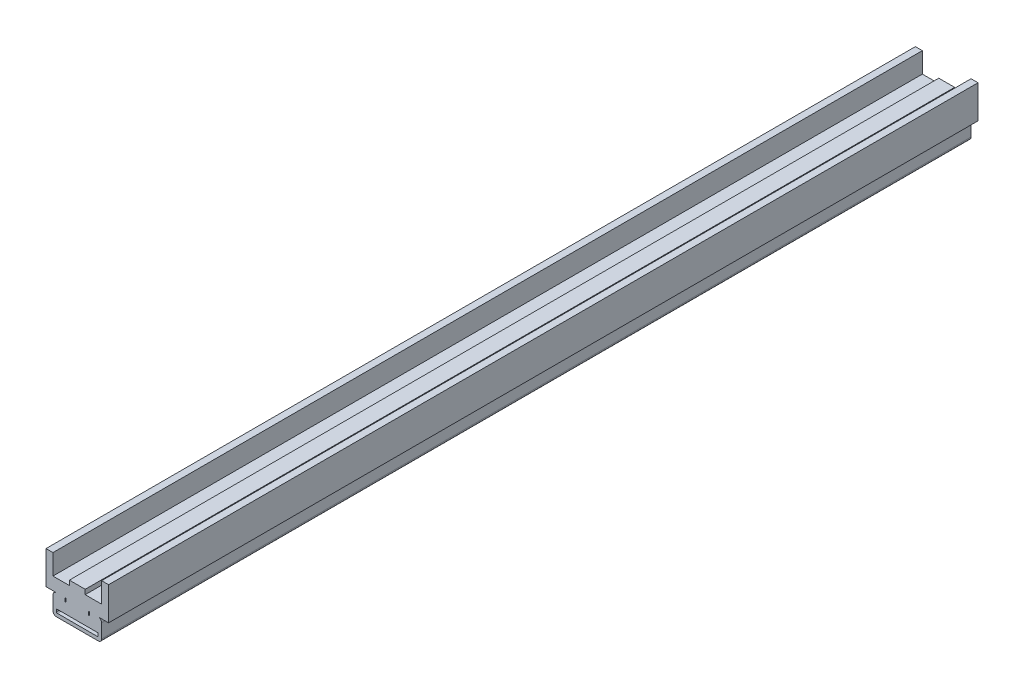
ISO-10303-21;
HEADER;
FILE_DESCRIPTION(('STEP AP214'),'2;1');
FILE_NAME('part.step','',(''),(''),'','','');
FILE_SCHEMA(('AUTOMOTIVE_DESIGN { 1 0 10303 214 1 1 1 1 }'));
ENDSEC;
DATA;
#1=APPLICATION_CONTEXT('core data for automotive mechanical design processes');
#2=APPLICATION_PROTOCOL_DEFINITION('international standard','automotive_design',2000,#1);
#3=PRODUCT_CONTEXT('',#1,'mechanical');
#4=PRODUCT('Part','Part','',(#3));
#5=PRODUCT_RELATED_PRODUCT_CATEGORY('part','',(#4));
#6=PRODUCT_DEFINITION_FORMATION('','',#4);
#7=PRODUCT_DEFINITION_CONTEXT('part definition',#1,'design');
#8=PRODUCT_DEFINITION('design','',#6,#7);
#9=PRODUCT_DEFINITION_SHAPE('','',#8);
#10=(LENGTH_UNIT() NAMED_UNIT(*) SI_UNIT(.MILLI.,.METRE.));
#11=(NAMED_UNIT(*) PLANE_ANGLE_UNIT() SI_UNIT($,.RADIAN.));
#12=(NAMED_UNIT(*) SI_UNIT($,.STERADIAN.) SOLID_ANGLE_UNIT());
#13=UNCERTAINTY_MEASURE_WITH_UNIT(LENGTH_MEASURE(1.E-05),#10,'distance_accuracy_value','');
#14=(GEOMETRIC_REPRESENTATION_CONTEXT(3) GLOBAL_UNCERTAINTY_ASSIGNED_CONTEXT((#13)) GLOBAL_UNIT_ASSIGNED_CONTEXT((#10,
#11,#12)) REPRESENTATION_CONTEXT('',''));
#15=CARTESIAN_POINT('',(0.,0.,0.));
#16=DIRECTION('',(0.,0.,1.));
#17=DIRECTION('',(1.,0.,0.));
#18=AXIS2_PLACEMENT_3D('',#15,#16,#17);
#19=CARTESIAN_POINT('',(12.0000057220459,9.99999999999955,500.));
#20=DIRECTION('',(0.,0.,-1.));
#21=DIRECTION('',(-1.,0.,0.));
#22=AXIS2_PLACEMENT_3D('',#19,#20,#21);
#23=PLANE('',#22);
#24=DIRECTION('',(0.,-1.,0.));
#25=VECTOR('',#24,1.);
#26=CARTESIAN_POINT('',(6.5,11.9999999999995,500.));
#27=LINE('',#26,#25);
#28=CARTESIAN_POINT('',(6.5,11.9999999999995,500.));
#29=VERTEX_POINT('',#28);
#30=CARTESIAN_POINT('',(6.5,9.99999999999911,500.));
#31=VERTEX_POINT('',#30);
#32=EDGE_CURVE('E277',#29,#31,#27,.T.);
#33=ORIENTED_EDGE('',*,*,#32,.F.);
#34=DIRECTION('',(-1.,0.,0.));
#35=VECTOR('',#34,1.);
#36=CARTESIAN_POINT('',(6.5,11.9999999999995,500.));
#37=LINE('',#36,#35);
#38=CARTESIAN_POINT('',(7.,11.9999999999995,500.));
#39=VERTEX_POINT('',#38);
#40=EDGE_CURVE('E285',#39,#29,#37,.T.);
#41=ORIENTED_EDGE('',*,*,#40,.F.);
#42=DIRECTION('',(0.,1.,0.));
#43=VECTOR('',#42,1.);
#44=CARTESIAN_POINT('',(7.,11.9999999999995,500.));
#45=LINE('',#44,#43);
#46=CARTESIAN_POINT('',(7.,9.99999999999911,500.));
#47=VERTEX_POINT('',#46);
#48=EDGE_CURVE('E282',#47,#39,#45,.T.);
#49=ORIENTED_EDGE('',*,*,#48,.F.);
#50=DIRECTION('',(1.,0.,0.));
#51=VECTOR('',#50,1.);
#52=CARTESIAN_POINT('',(6.5,9.99999999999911,500.));
#53=LINE('',#52,#51);
#54=EDGE_CURVE('E279',#31,#47,#53,.T.);
#55=ORIENTED_EDGE('',*,*,#54,.F.);
#56=EDGE_LOOP('',(#33,#41,#49,#55));
#57=FACE_BOUND('',#56,.T.);
#58=DIRECTION('',(1.,0.,0.));
#59=VECTOR('',#58,1.);
#60=CARTESIAN_POINT('',(-14.0000057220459,0.,500.));
#61=LINE('',#60,#59);
#62=CARTESIAN_POINT('',(-12.0000057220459,0.,500.));
#63=VERTEX_POINT('',#62);
#64=CARTESIAN_POINT('',(12.0000057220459,0.,500.));
#65=VERTEX_POINT('',#64);
#66=EDGE_CURVE('E334',#63,#65,#61,.T.);
#67=ORIENTED_EDGE('',*,*,#66,.T.);
#68=CARTESIAN_POINT('',(12.0000057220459,2.,500.));
#69=DIRECTION('',(0.,0.,-1.));
#70=DIRECTION('',(-1.,0.,0.));
#71=AXIS2_PLACEMENT_3D('',#68,#69,#70);
#72=CIRCLE('',#71,2.);
#73=CARTESIAN_POINT('',(14.0000057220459,2.,500.));
#74=VERTEX_POINT('',#73);
#75=EDGE_CURVE('E471',#65,#74,#72,.F.);
#76=ORIENTED_EDGE('',*,*,#75,.T.);
#77=DIRECTION('',(0.,1.,0.));
#78=VECTOR('',#77,1.);
#79=CARTESIAN_POINT('',(14.0000057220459,9.99999999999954,500.));
#80=LINE('',#79,#78);
#81=CARTESIAN_POINT('',(14.0000057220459,9.99999999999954,500.));
#82=VERTEX_POINT('',#81);
#83=EDGE_CURVE('E337',#74,#82,#80,.T.);
#84=ORIENTED_EDGE('',*,*,#83,.T.);
#85=CARTESIAN_POINT('',(12.0000057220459,9.99999999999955,500.));
#86=DIRECTION('',(0.,0.,1.));
#87=DIRECTION('',(-1.,0.,0.));
#88=AXIS2_PLACEMENT_3D('',#85,#86,#87);
#89=CIRCLE('',#88,2.);
#90=CARTESIAN_POINT('',(12.0000057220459,11.9999999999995,500.));
#91=VERTEX_POINT('',#90);
#92=EDGE_CURVE('E340',#82,#91,#89,.T.);
#93=ORIENTED_EDGE('',*,*,#92,.T.);
#94=DIRECTION('',(1.,0.,0.));
#95=VECTOR('',#94,1.);
#96=CARTESIAN_POINT('',(12.0000057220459,11.9999999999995,500.));
#97=LINE('',#96,#95);
#98=CARTESIAN_POINT('',(18.,11.9999999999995,500.));
#99=VERTEX_POINT('',#98);
#100=EDGE_CURVE('E342',#91,#99,#97,.T.);
#101=ORIENTED_EDGE('',*,*,#100,.T.);
#102=DIRECTION('',(0.,1.,0.));
#103=VECTOR('',#102,1.);
#104=CARTESIAN_POINT('',(18.,30.9999999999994,500.));
#105=LINE('',#104,#103);
#106=CARTESIAN_POINT('',(18.,30.9999999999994,500.));
#107=VERTEX_POINT('',#106);
#108=EDGE_CURVE('E344',#99,#107,#105,.T.);
#109=ORIENTED_EDGE('',*,*,#108,.T.);
#110=DIRECTION('',(-1.,0.,0.));
#111=VECTOR('',#110,1.);
#112=CARTESIAN_POINT('',(14.0000000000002,30.9999999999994,500.));
#113=LINE('',#112,#111);
#114=CARTESIAN_POINT('',(14.0000000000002,30.9999999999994,500.));
#115=VERTEX_POINT('',#114);
#116=EDGE_CURVE('E346',#107,#115,#113,.T.);
#117=ORIENTED_EDGE('',*,*,#116,.T.);
#118=DIRECTION('',(0.,-1.,0.));
#119=VECTOR('',#118,1.);
#120=CARTESIAN_POINT('',(14.0000000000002,30.9999999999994,500.));
#121=LINE('',#120,#119);
#122=CARTESIAN_POINT('',(14.0000000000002,19.3,500.));
#123=VERTEX_POINT('',#122);
#124=EDGE_CURVE('E348',#115,#123,#121,.T.);
#125=ORIENTED_EDGE('',*,*,#124,.T.);
#126=DIRECTION('',(-1.,0.,0.));
#127=VECTOR('',#126,1.);
#128=CARTESIAN_POINT('',(4.55,19.3,500.));
#129=LINE('',#128,#127);
#130=CARTESIAN_POINT('',(4.55,19.3,500.));
#131=VERTEX_POINT('',#130);
#132=EDGE_CURVE('E350',#123,#131,#129,.T.);
#133=ORIENTED_EDGE('',*,*,#132,.T.);
#134=DIRECTION('',(0.,1.,0.));
#135=VECTOR('',#134,1.);
#136=CARTESIAN_POINT('',(4.55,22.,500.));
#137=LINE('',#136,#135);
#138=CARTESIAN_POINT('',(4.55,22.,500.));
#139=VERTEX_POINT('',#138);
#140=EDGE_CURVE('E352',#131,#139,#137,.T.);
#141=ORIENTED_EDGE('',*,*,#140,.T.);
#142=DIRECTION('',(-1.,0.,0.));
#143=VECTOR('',#142,1.);
#144=CARTESIAN_POINT('',(-4.55,22.,500.));
#145=LINE('',#144,#143);
#146=CARTESIAN_POINT('',(-4.55,22.,500.));
#147=VERTEX_POINT('',#146);
#148=EDGE_CURVE('E354',#139,#147,#145,.T.);
#149=ORIENTED_EDGE('',*,*,#148,.T.);
#150=DIRECTION('',(0.,-1.,0.));
#151=VECTOR('',#150,1.);
#152=CARTESIAN_POINT('',(-4.55,22.,500.));
#153=LINE('',#152,#151);
#154=CARTESIAN_POINT('',(-4.55,19.3,500.));
#155=VERTEX_POINT('',#154);
#156=EDGE_CURVE('E356',#147,#155,#153,.T.);
#157=ORIENTED_EDGE('',*,*,#156,.T.);
#158=DIRECTION('',(-1.,0.,0.));
#159=VECTOR('',#158,1.);
#160=CARTESIAN_POINT('',(-14.0000000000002,19.3,500.));
#161=LINE('',#160,#159);
#162=CARTESIAN_POINT('',(-14.0000000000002,19.3,500.));
#163=VERTEX_POINT('',#162);
#164=EDGE_CURVE('E358',#155,#163,#161,.T.);
#165=ORIENTED_EDGE('',*,*,#164,.T.);
#166=DIRECTION('',(0.,1.,0.));
#167=VECTOR('',#166,1.);
#168=CARTESIAN_POINT('',(-14.0000000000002,31.,500.));
#169=LINE('',#168,#167);
#170=CARTESIAN_POINT('',(-14.0000000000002,31.,500.));
#171=VERTEX_POINT('',#170);
#172=EDGE_CURVE('E360',#163,#171,#169,.T.);
#173=ORIENTED_EDGE('',*,*,#172,.T.);
#174=DIRECTION('',(-1.,0.,0.));
#175=VECTOR('',#174,1.);
#176=CARTESIAN_POINT('',(-18.,31.,500.));
#177=LINE('',#176,#175);
#178=CARTESIAN_POINT('',(-18.,31.,500.));
#179=VERTEX_POINT('',#178);
#180=EDGE_CURVE('E362',#171,#179,#177,.T.);
#181=ORIENTED_EDGE('',*,*,#180,.T.);
#182=DIRECTION('',(0.,-1.,0.));
#183=VECTOR('',#182,1.);
#184=CARTESIAN_POINT('',(-18.,31.,500.));
#185=LINE('',#184,#183);
#186=CARTESIAN_POINT('',(-18.,12.,500.));
#187=VERTEX_POINT('',#186);
#188=EDGE_CURVE('E364',#179,#187,#185,.T.);
#189=ORIENTED_EDGE('',*,*,#188,.T.);
#190=DIRECTION('',(1.,0.,0.));
#191=VECTOR('',#190,1.);
#192=CARTESIAN_POINT('',(-18.,12.,500.));
#193=LINE('',#192,#191);
#194=CARTESIAN_POINT('',(-12.0000057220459,12.,500.));
#195=VERTEX_POINT('',#194);
#196=EDGE_CURVE('E366',#187,#195,#193,.T.);
#197=ORIENTED_EDGE('',*,*,#196,.T.);
#198=CARTESIAN_POINT('',(-12.0000057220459,10.,500.));
#199=DIRECTION('',(0.,0.,1.));
#200=DIRECTION('',(1.,0.,0.));
#201=AXIS2_PLACEMENT_3D('',#198,#199,#200);
#202=CIRCLE('',#201,2.);
#203=CARTESIAN_POINT('',(-14.0000057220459,10.,500.));
#204=VERTEX_POINT('',#203);
#205=EDGE_CURVE('E368',#195,#204,#202,.T.);
#206=ORIENTED_EDGE('',*,*,#205,.T.);
#207=DIRECTION('',(0.,-1.,0.));
#208=VECTOR('',#207,1.);
#209=CARTESIAN_POINT('',(-14.0000057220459,10.,500.));
#210=LINE('',#209,#208);
#211=CARTESIAN_POINT('',(-14.0000057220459,2.,500.));
#212=VERTEX_POINT('',#211);
#213=EDGE_CURVE('E370',#204,#212,#210,.T.);
#214=ORIENTED_EDGE('',*,*,#213,.T.);
#215=CARTESIAN_POINT('',(-12.0000057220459,2.,500.));
#216=DIRECTION('',(0.,0.,-1.));
#217=DIRECTION('',(-1.,0.,0.));
#218=AXIS2_PLACEMENT_3D('',#215,#216,#217);
#219=CIRCLE('',#218,2.);
#220=EDGE_CURVE('E469',#212,#63,#219,.F.);
#221=ORIENTED_EDGE('',*,*,#220,.T.);
#222=EDGE_LOOP('',(#67,#76,#84,#93,#101,#109,#117,#125,#133,#141,#149,#157,#165,#173,#181,#189,
#197,#206,#214,#221));
#223=FACE_BOUND('',#222,.T.);
#224=DIRECTION('',(1.,0.,0.));
#225=VECTOR('',#224,1.);
#226=CARTESIAN_POINT('',(-12.0000057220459,2.,500.));
#227=LINE('',#226,#225);
#228=CARTESIAN_POINT('',(-11.5000057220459,2.,500.));
#229=VERTEX_POINT('',#228);
#230=CARTESIAN_POINT('',(11.499993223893,2.,500.));
#231=VERTEX_POINT('',#230);
#232=EDGE_CURVE('E308',#229,#231,#227,.T.);
#233=ORIENTED_EDGE('',*,*,#232,.F.);
#234=CARTESIAN_POINT('',(-11.5000057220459,2.5,500.));
#235=DIRECTION('',(0.,0.,-1.));
#236=DIRECTION('',(-1.,0.,0.));
#237=AXIS2_PLACEMENT_3D('',#234,#235,#236);
#238=CIRCLE('',#237,0.5);
#239=CARTESIAN_POINT('',(-12.0000057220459,2.5,500.));
#240=VERTEX_POINT('',#239);
#241=EDGE_CURVE('E9',#229,#240,#238,.T.);
#242=ORIENTED_EDGE('',*,*,#241,.T.);
#243=DIRECTION('',(0.,-1.,0.));
#244=VECTOR('',#243,1.);
#245=CARTESIAN_POINT('',(-12.0000057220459,4.00000000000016,500.));
#246=LINE('',#245,#244);
#247=CARTESIAN_POINT('',(-12.0000057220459,4.00000000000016,500.));
#248=VERTEX_POINT('',#247);
#249=EDGE_CURVE('E317',#248,#240,#246,.T.);
#250=ORIENTED_EDGE('',*,*,#249,.F.);
#251=DIRECTION('',(-1.,0.,0.));
#252=VECTOR('',#251,1.);
#253=CARTESIAN_POINT('',(-12.0000057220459,4.00000000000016,500.));
#254=LINE('',#253,#252);
#255=CARTESIAN_POINT('',(11.999993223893,4.00000000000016,500.));
#256=VERTEX_POINT('',#255);
#257=EDGE_CURVE('E314',#256,#248,#254,.T.);
#258=ORIENTED_EDGE('',*,*,#257,.F.);
#259=DIRECTION('',(0.,1.,0.));
#260=VECTOR('',#259,1.);
#261=CARTESIAN_POINT('',(11.999993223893,4.00000000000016,500.));
#262=LINE('',#261,#260);
#263=CARTESIAN_POINT('',(11.999993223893,2.5,500.));
#264=VERTEX_POINT('',#263);
#265=EDGE_CURVE('E311',#264,#256,#262,.T.);
#266=ORIENTED_EDGE('',*,*,#265,.F.);
#267=CARTESIAN_POINT('',(11.499993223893,2.5,500.));
#268=DIRECTION('',(0.,0.,-1.));
#269=DIRECTION('',(-1.,0.,0.));
#270=AXIS2_PLACEMENT_3D('',#267,#268,#269);
#271=CIRCLE('',#270,0.5);
#272=EDGE_CURVE('E486',#264,#231,#271,.T.);
#273=ORIENTED_EDGE('',*,*,#272,.T.);
#274=EDGE_LOOP('',(#233,#242,#250,#258,#266,#273));
#275=FACE_BOUND('',#274,.T.);
#276=DIRECTION('',(0.,1.,0.));
#277=VECTOR('',#276,1.);
#278=CARTESIAN_POINT('',(-6.5,11.9999999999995,500.));
#279=LINE('',#278,#277);
#280=CARTESIAN_POINT('',(-6.5,9.99999999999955,500.));
#281=VERTEX_POINT('',#280);
#282=CARTESIAN_POINT('',(-6.5,11.9999999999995,500.));
#283=VERTEX_POINT('',#282);
#284=EDGE_CURVE('E236',#281,#283,#279,.T.);
#285=ORIENTED_EDGE('',*,*,#284,.F.);
#286=DIRECTION('',(1.,0.,0.));
#287=VECTOR('',#286,1.);
#288=CARTESIAN_POINT('',(-6.5,9.99999999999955,500.));
#289=LINE('',#288,#287);
#290=CARTESIAN_POINT('',(-7.,9.99999999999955,500.));
#291=VERTEX_POINT('',#290);
#292=EDGE_CURVE('E261',#291,#281,#289,.T.);
#293=ORIENTED_EDGE('',*,*,#292,.F.);
#294=DIRECTION('',(0.,-1.,0.));
#295=VECTOR('',#294,1.);
#296=CARTESIAN_POINT('',(-7.,11.9999999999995,500.));
#297=LINE('',#296,#295);
#298=CARTESIAN_POINT('',(-7.,11.9999999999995,500.));
#299=VERTEX_POINT('',#298);
#300=EDGE_CURVE('E259',#299,#291,#297,.T.);
#301=ORIENTED_EDGE('',*,*,#300,.F.);
#302=DIRECTION('',(-1.,0.,0.));
#303=VECTOR('',#302,1.);
#304=CARTESIAN_POINT('',(-7.,11.9999999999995,500.));
#305=LINE('',#304,#303);
#306=EDGE_CURVE('E246',#283,#299,#305,.T.);
#307=ORIENTED_EDGE('',*,*,#306,.F.);
#308=EDGE_LOOP('',(#285,#293,#301,#307));
#309=FACE_BOUND('',#308,.T.);
#310=ADVANCED_FACE('F14',(#57,#223,#275,#309),#23,.F.);
#311=CARTESIAN_POINT('',(12.0000057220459,9.99999999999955,0.));
#312=DIRECTION('',(0.,0.,-1.));
#313=DIRECTION('',(-1.,0.,0.));
#314=AXIS2_PLACEMENT_3D('',#311,#312,#313);
#315=PLANE('',#314);
#316=DIRECTION('',(-1.,0.,0.));
#317=VECTOR('',#316,1.);
#318=CARTESIAN_POINT('',(6.5,11.9999999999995,0.));
#319=LINE('',#318,#317);
#320=CARTESIAN_POINT('',(7.,11.9999999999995,0.));
#321=VERTEX_POINT('',#320);
#322=CARTESIAN_POINT('',(6.5,11.9999999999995,0.));
#323=VERTEX_POINT('',#322);
#324=EDGE_CURVE('E280',#321,#323,#319,.T.);
#325=ORIENTED_EDGE('',*,*,#324,.T.);
#326=DIRECTION('',(0.,-1.,0.));
#327=VECTOR('',#326,1.);
#328=CARTESIAN_POINT('',(6.5,11.9999999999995,0.));
#329=LINE('',#328,#327);
#330=CARTESIAN_POINT('',(6.5,9.99999999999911,0.));
#331=VERTEX_POINT('',#330);
#332=EDGE_CURVE('E254',#323,#331,#329,.T.);
#333=ORIENTED_EDGE('',*,*,#332,.T.);
#334=DIRECTION('',(1.,0.,0.));
#335=VECTOR('',#334,1.);
#336=CARTESIAN_POINT('',(6.5,9.99999999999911,0.));
#337=LINE('',#336,#335);
#338=CARTESIAN_POINT('',(7.,9.99999999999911,0.));
#339=VERTEX_POINT('',#338);
#340=EDGE_CURVE('E290',#331,#339,#337,.T.);
#341=ORIENTED_EDGE('',*,*,#340,.T.);
#342=DIRECTION('',(0.,1.,0.));
#343=VECTOR('',#342,1.);
#344=CARTESIAN_POINT('',(7.,11.9999999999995,0.));
#345=LINE('',#344,#343);
#346=EDGE_CURVE('E293',#339,#321,#345,.T.);
#347=ORIENTED_EDGE('',*,*,#346,.T.);
#348=EDGE_LOOP('',(#325,#333,#341,#347));
#349=FACE_BOUND('',#348,.T.);
#350=DIRECTION('',(0.,1.,0.));
#351=VECTOR('',#350,1.);
#352=CARTESIAN_POINT('',(14.0000057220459,9.99999999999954,0.));
#353=LINE('',#352,#351);
#354=CARTESIAN_POINT('',(14.0000057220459,2.,0.));
#355=VERTEX_POINT('',#354);
#356=CARTESIAN_POINT('',(14.0000057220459,9.99999999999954,0.));
#357=VERTEX_POINT('',#356);
#358=EDGE_CURVE('E376',#355,#357,#353,.T.);
#359=ORIENTED_EDGE('',*,*,#358,.F.);
#360=CARTESIAN_POINT('',(12.0000057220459,2.,0.));
#361=DIRECTION('',(0.,0.,-1.));
#362=DIRECTION('',(-1.,0.,0.));
#363=AXIS2_PLACEMENT_3D('',#360,#361,#362);
#364=CIRCLE('',#363,2.);
#365=CARTESIAN_POINT('',(12.0000057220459,0.,0.));
#366=VERTEX_POINT('',#365);
#367=EDGE_CURVE('E462',#355,#366,#364,.T.);
#368=ORIENTED_EDGE('',*,*,#367,.T.);
#369=DIRECTION('',(1.,0.,0.));
#370=VECTOR('',#369,1.);
#371=CARTESIAN_POINT('',(-14.0000057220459,0.,0.));
#372=LINE('',#371,#370);
#373=CARTESIAN_POINT('',(-12.0000057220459,0.,0.));
#374=VERTEX_POINT('',#373);
#375=EDGE_CURVE('E333',#374,#366,#372,.T.);
#376=ORIENTED_EDGE('',*,*,#375,.F.);
#377=CARTESIAN_POINT('',(-12.0000057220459,2.,0.));
#378=DIRECTION('',(0.,0.,-1.));
#379=DIRECTION('',(-1.,0.,0.));
#380=AXIS2_PLACEMENT_3D('',#377,#378,#379);
#381=CIRCLE('',#380,2.);
#382=CARTESIAN_POINT('',(-14.0000057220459,2.,0.));
#383=VERTEX_POINT('',#382);
#384=EDGE_CURVE('E460',#374,#383,#381,.T.);
#385=ORIENTED_EDGE('',*,*,#384,.T.);
#386=DIRECTION('',(0.,-1.,0.));
#387=VECTOR('',#386,1.);
#388=CARTESIAN_POINT('',(-14.0000057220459,10.,0.));
#389=LINE('',#388,#387);
#390=CARTESIAN_POINT('',(-14.0000057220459,10.,0.));
#391=VERTEX_POINT('',#390);
#392=EDGE_CURVE('E338',#391,#383,#389,.T.);
#393=ORIENTED_EDGE('',*,*,#392,.F.);
#394=CARTESIAN_POINT('',(-12.0000057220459,10.,0.));
#395=DIRECTION('',(0.,0.,1.));
#396=DIRECTION('',(1.,0.,0.));
#397=AXIS2_PLACEMENT_3D('',#394,#395,#396);
#398=CIRCLE('',#397,2.);
#399=CARTESIAN_POINT('',(-12.0000057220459,12.,0.));
#400=VERTEX_POINT('',#399);
#401=EDGE_CURVE('E406',#400,#391,#398,.T.);
#402=ORIENTED_EDGE('',*,*,#401,.F.);
#403=DIRECTION('',(1.,0.,0.));
#404=VECTOR('',#403,1.);
#405=CARTESIAN_POINT('',(-18.,12.,0.));
#406=LINE('',#405,#404);
#407=CARTESIAN_POINT('',(-18.,12.,0.));
#408=VERTEX_POINT('',#407);
#409=EDGE_CURVE('E404',#408,#400,#406,.T.);
#410=ORIENTED_EDGE('',*,*,#409,.F.);
#411=DIRECTION('',(0.,-1.,0.));
#412=VECTOR('',#411,1.);
#413=CARTESIAN_POINT('',(-18.,31.,0.));
#414=LINE('',#413,#412);
#415=CARTESIAN_POINT('',(-18.,31.,0.));
#416=VERTEX_POINT('',#415);
#417=EDGE_CURVE('E402',#416,#408,#414,.T.);
#418=ORIENTED_EDGE('',*,*,#417,.F.);
#419=DIRECTION('',(-1.,0.,0.));
#420=VECTOR('',#419,1.);
#421=CARTESIAN_POINT('',(-18.,31.,0.));
#422=LINE('',#421,#420);
#423=CARTESIAN_POINT('',(-14.0000000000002,31.,0.));
#424=VERTEX_POINT('',#423);
#425=EDGE_CURVE('E400',#424,#416,#422,.T.);
#426=ORIENTED_EDGE('',*,*,#425,.F.);
#427=DIRECTION('',(0.,1.,0.));
#428=VECTOR('',#427,1.);
#429=CARTESIAN_POINT('',(-14.0000000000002,31.,0.));
#430=LINE('',#429,#428);
#431=CARTESIAN_POINT('',(-14.0000000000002,19.3,0.));
#432=VERTEX_POINT('',#431);
#433=EDGE_CURVE('E398',#432,#424,#430,.T.);
#434=ORIENTED_EDGE('',*,*,#433,.F.);
#435=DIRECTION('',(-1.,0.,0.));
#436=VECTOR('',#435,1.);
#437=CARTESIAN_POINT('',(-14.0000000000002,19.3,0.));
#438=LINE('',#437,#436);
#439=CARTESIAN_POINT('',(-4.55,19.3,0.));
#440=VERTEX_POINT('',#439);
#441=EDGE_CURVE('E396',#440,#432,#438,.T.);
#442=ORIENTED_EDGE('',*,*,#441,.F.);
#443=DIRECTION('',(0.,-1.,0.));
#444=VECTOR('',#443,1.);
#445=CARTESIAN_POINT('',(-4.55,22.,0.));
#446=LINE('',#445,#444);
#447=CARTESIAN_POINT('',(-4.55,22.,0.));
#448=VERTEX_POINT('',#447);
#449=EDGE_CURVE('E394',#448,#440,#446,.T.);
#450=ORIENTED_EDGE('',*,*,#449,.F.);
#451=DIRECTION('',(-1.,0.,0.));
#452=VECTOR('',#451,1.);
#453=CARTESIAN_POINT('',(-4.55,22.,0.));
#454=LINE('',#453,#452);
#455=CARTESIAN_POINT('',(4.55,22.,0.));
#456=VERTEX_POINT('',#455);
#457=EDGE_CURVE('E392',#456,#448,#454,.T.);
#458=ORIENTED_EDGE('',*,*,#457,.F.);
#459=DIRECTION('',(0.,1.,0.));
#460=VECTOR('',#459,1.);
#461=CARTESIAN_POINT('',(4.55,22.,0.));
#462=LINE('',#461,#460);
#463=CARTESIAN_POINT('',(4.55,19.3,0.));
#464=VERTEX_POINT('',#463);
#465=EDGE_CURVE('E390',#464,#456,#462,.T.);
#466=ORIENTED_EDGE('',*,*,#465,.F.);
#467=DIRECTION('',(-1.,0.,0.));
#468=VECTOR('',#467,1.);
#469=CARTESIAN_POINT('',(4.55,19.3,0.));
#470=LINE('',#469,#468);
#471=CARTESIAN_POINT('',(14.0000000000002,19.3,0.));
#472=VERTEX_POINT('',#471);
#473=EDGE_CURVE('E388',#472,#464,#470,.T.);
#474=ORIENTED_EDGE('',*,*,#473,.F.);
#475=DIRECTION('',(0.,-1.,0.));
#476=VECTOR('',#475,1.);
#477=CARTESIAN_POINT('',(14.0000000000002,30.9999999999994,0.));
#478=LINE('',#477,#476);
#479=CARTESIAN_POINT('',(14.0000000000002,30.9999999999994,0.));
#480=VERTEX_POINT('',#479);
#481=EDGE_CURVE('E386',#480,#472,#478,.T.);
#482=ORIENTED_EDGE('',*,*,#481,.F.);
#483=DIRECTION('',(-1.,0.,0.));
#484=VECTOR('',#483,1.);
#485=CARTESIAN_POINT('',(14.0000000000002,30.9999999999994,0.));
#486=LINE('',#485,#484);
#487=CARTESIAN_POINT('',(18.,30.9999999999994,0.));
#488=VERTEX_POINT('',#487);
#489=EDGE_CURVE('E384',#488,#480,#486,.T.);
#490=ORIENTED_EDGE('',*,*,#489,.F.);
#491=DIRECTION('',(0.,1.,0.));
#492=VECTOR('',#491,1.);
#493=CARTESIAN_POINT('',(18.,30.9999999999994,0.));
#494=LINE('',#493,#492);
#495=CARTESIAN_POINT('',(18.,11.9999999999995,0.));
#496=VERTEX_POINT('',#495);
#497=EDGE_CURVE('E382',#496,#488,#494,.T.);
#498=ORIENTED_EDGE('',*,*,#497,.F.);
#499=DIRECTION('',(1.,0.,0.));
#500=VECTOR('',#499,1.);
#501=CARTESIAN_POINT('',(12.0000057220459,11.9999999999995,0.));
#502=LINE('',#501,#500);
#503=CARTESIAN_POINT('',(12.0000057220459,11.9999999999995,0.));
#504=VERTEX_POINT('',#503);
#505=EDGE_CURVE('E380',#504,#496,#502,.T.);
#506=ORIENTED_EDGE('',*,*,#505,.F.);
#507=CARTESIAN_POINT('',(12.0000057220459,9.99999999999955,0.));
#508=DIRECTION('',(0.,0.,1.));
#509=DIRECTION('',(-1.,0.,0.));
#510=AXIS2_PLACEMENT_3D('',#507,#508,#509);
#511=CIRCLE('',#510,2.);
#512=EDGE_CURVE('E378',#357,#504,#511,.T.);
#513=ORIENTED_EDGE('',*,*,#512,.F.);
#514=EDGE_LOOP('',(#359,#368,#376,#385,#393,#402,#410,#418,#426,#434,#442,#450,#458,#466,#474,
#482,#490,#498,#506,#513));
#515=FACE_BOUND('',#514,.T.);
#516=DIRECTION('',(0.,-1.,0.));
#517=VECTOR('',#516,1.);
#518=CARTESIAN_POINT('',(-12.0000057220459,4.00000000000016,0.));
#519=LINE('',#518,#517);
#520=CARTESIAN_POINT('',(-12.0000057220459,4.00000000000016,0.));
#521=VERTEX_POINT('',#520);
#522=CARTESIAN_POINT('',(-12.0000057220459,2.5,0.));
#523=VERTEX_POINT('',#522);
#524=EDGE_CURVE('E312',#521,#523,#519,.T.);
#525=ORIENTED_EDGE('',*,*,#524,.T.);
#526=CARTESIAN_POINT('',(-11.5000057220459,2.5,0.));
#527=DIRECTION('',(0.,0.,-1.));
#528=DIRECTION('',(-1.,0.,0.));
#529=AXIS2_PLACEMENT_3D('',#526,#527,#528);
#530=CIRCLE('',#529,0.5);
#531=CARTESIAN_POINT('',(-11.5000057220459,2.,0.));
#532=VERTEX_POINT('',#531);
#533=EDGE_CURVE('E22',#523,#532,#530,.F.);
#534=ORIENTED_EDGE('',*,*,#533,.T.);
#535=DIRECTION('',(1.,0.,0.));
#536=VECTOR('',#535,1.);
#537=CARTESIAN_POINT('',(-12.0000057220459,2.,0.));
#538=LINE('',#537,#536);
#539=CARTESIAN_POINT('',(11.499993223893,2.,0.));
#540=VERTEX_POINT('',#539);
#541=EDGE_CURVE('E307',#532,#540,#538,.T.);
#542=ORIENTED_EDGE('',*,*,#541,.T.);
#543=CARTESIAN_POINT('',(11.499993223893,2.5,0.));
#544=DIRECTION('',(0.,0.,-1.));
#545=DIRECTION('',(-1.,0.,0.));
#546=AXIS2_PLACEMENT_3D('',#543,#544,#545);
#547=CIRCLE('',#546,0.5);
#548=CARTESIAN_POINT('',(11.999993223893,2.5,0.));
#549=VERTEX_POINT('',#548);
#550=EDGE_CURVE('E484',#540,#549,#547,.F.);
#551=ORIENTED_EDGE('',*,*,#550,.T.);
#552=DIRECTION('',(0.,1.,0.));
#553=VECTOR('',#552,1.);
#554=CARTESIAN_POINT('',(11.999993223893,4.00000000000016,0.));
#555=LINE('',#554,#553);
#556=CARTESIAN_POINT('',(11.999993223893,4.00000000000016,0.));
#557=VERTEX_POINT('',#556);
#558=EDGE_CURVE('E322',#549,#557,#555,.T.);
#559=ORIENTED_EDGE('',*,*,#558,.T.);
#560=DIRECTION('',(-1.,0.,0.));
#561=VECTOR('',#560,1.);
#562=CARTESIAN_POINT('',(-12.0000057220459,4.00000000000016,0.));
#563=LINE('',#562,#561);
#564=EDGE_CURVE('E324',#557,#521,#563,.T.);
#565=ORIENTED_EDGE('',*,*,#564,.T.);
#566=EDGE_LOOP('',(#525,#534,#542,#551,#559,#565));
#567=FACE_BOUND('',#566,.T.);
#568=DIRECTION('',(1.,0.,0.));
#569=VECTOR('',#568,1.);
#570=CARTESIAN_POINT('',(-6.5,9.99999999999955,0.));
#571=LINE('',#570,#569);
#572=CARTESIAN_POINT('',(-7.,9.99999999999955,0.));
#573=VERTEX_POINT('',#572);
#574=CARTESIAN_POINT('',(-6.5,9.99999999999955,0.));
#575=VERTEX_POINT('',#574);
#576=EDGE_CURVE('E247',#573,#575,#571,.T.);
#577=ORIENTED_EDGE('',*,*,#576,.T.);
#578=DIRECTION('',(0.,1.,0.));
#579=VECTOR('',#578,1.);
#580=CARTESIAN_POINT('',(-6.5,11.9999999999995,0.));
#581=LINE('',#580,#579);
#582=CARTESIAN_POINT('',(-6.5,11.9999999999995,0.));
#583=VERTEX_POINT('',#582);
#584=EDGE_CURVE('E265',#575,#583,#581,.T.);
#585=ORIENTED_EDGE('',*,*,#584,.T.);
#586=DIRECTION('',(-1.,0.,0.));
#587=VECTOR('',#586,1.);
#588=CARTESIAN_POINT('',(-7.,11.9999999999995,0.));
#589=LINE('',#588,#587);
#590=CARTESIAN_POINT('',(-7.,11.9999999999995,0.));
#591=VERTEX_POINT('',#590);
#592=EDGE_CURVE('E253',#583,#591,#589,.T.);
#593=ORIENTED_EDGE('',*,*,#592,.T.);
#594=DIRECTION('',(0.,-1.,0.));
#595=VECTOR('',#594,1.);
#596=CARTESIAN_POINT('',(-7.,11.9999999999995,0.));
#597=LINE('',#596,#595);
#598=EDGE_CURVE('E268',#591,#573,#597,.T.);
#599=ORIENTED_EDGE('',*,*,#598,.T.);
#600=EDGE_LOOP('',(#577,#585,#593,#599));
#601=FACE_BOUND('',#600,.T.);
#602=ADVANCED_FACE('F489',(#349,#515,#567,#601),#315,.T.);
#603=CARTESIAN_POINT('',(-14.0000057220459,0.,500.));
#604=DIRECTION('',(0.,1.,0.));
#605=DIRECTION('',(0.,0.,1.));
#606=AXIS2_PLACEMENT_3D('',#603,#604,#605);
#607=PLANE('',#606);
#608=ORIENTED_EDGE('',*,*,#375,.T.);
#609=DIRECTION('',(0.,0.,-1.));
#610=VECTOR('',#609,1.);
#611=CARTESIAN_POINT('',(12.0000057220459,0.,500.));
#612=LINE('',#611,#610);
#613=EDGE_CURVE('E467',#366,#65,#612,.F.);
#614=ORIENTED_EDGE('',*,*,#613,.T.);
#615=ORIENTED_EDGE('',*,*,#66,.F.);
#616=DIRECTION('',(0.,0.,-1.));
#617=VECTOR('',#616,1.);
#618=CARTESIAN_POINT('',(-12.0000057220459,0.,500.));
#619=LINE('',#618,#617);
#620=EDGE_CURVE('E464',#63,#374,#619,.T.);
#621=ORIENTED_EDGE('',*,*,#620,.T.);
#622=EDGE_LOOP('',(#608,#614,#615,#621));
#623=FACE_BOUND('',#622,.T.);
#624=ADVANCED_FACE('F528',(#623),#607,.F.);
#625=CARTESIAN_POINT('',(14.0000057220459,9.99999999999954,500.));
#626=DIRECTION('',(-1.,0.,0.));
#627=DIRECTION('',(0.,0.,1.));
#628=AXIS2_PLACEMENT_3D('',#625,#626,#627);
#629=PLANE('',#628);
#630=ORIENTED_EDGE('',*,*,#83,.F.);
#631=DIRECTION('',(0.,0.,-1.));
#632=VECTOR('',#631,1.);
#633=CARTESIAN_POINT('',(14.0000057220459,2.,500.));
#634=LINE('',#633,#632);
#635=EDGE_CURVE('E457',#74,#355,#634,.T.);
#636=ORIENTED_EDGE('',*,*,#635,.T.);
#637=ORIENTED_EDGE('',*,*,#358,.T.);
#638=DIRECTION('',(0.,0.,-1.));
#639=VECTOR('',#638,1.);
#640=CARTESIAN_POINT('',(14.0000057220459,9.99999999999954,500.));
#641=LINE('',#640,#639);
#642=EDGE_CURVE('E454',#82,#357,#641,.T.);
#643=ORIENTED_EDGE('',*,*,#642,.F.);
#644=EDGE_LOOP('',(#630,#636,#637,#643));
#645=FACE_BOUND('',#644,.T.);
#646=ADVANCED_FACE('F599',(#645),#629,.F.);
#647=CARTESIAN_POINT('',(12.0000057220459,9.99999999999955,500.));
#648=DIRECTION('',(0.,0.,-1.));
#649=DIRECTION('',(-1.,0.,0.));
#650=AXIS2_PLACEMENT_3D('',#647,#648,#649);
#651=CYLINDRICAL_SURFACE('',#650,2.);
#652=ORIENTED_EDGE('',*,*,#512,.T.);
#653=DIRECTION('',(0.,0.,-1.));
#654=VECTOR('',#653,1.);
#655=CARTESIAN_POINT('',(12.0000057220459,11.9999999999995,500.));
#656=LINE('',#655,#654);
#657=EDGE_CURVE('E451',#91,#504,#656,.T.);
#658=ORIENTED_EDGE('',*,*,#657,.F.);
#659=ORIENTED_EDGE('',*,*,#92,.F.);
#660=ORIENTED_EDGE('',*,*,#642,.T.);
#661=EDGE_LOOP('',(#652,#658,#659,#660));
#662=FACE_BOUND('',#661,.T.);
#663=ADVANCED_FACE('F595',(#662),#651,.T.);
#664=CARTESIAN_POINT('',(12.0000057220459,11.9999999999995,500.));
#665=DIRECTION('',(0.,1.,0.));
#666=DIRECTION('',(0.,0.,1.));
#667=AXIS2_PLACEMENT_3D('',#664,#665,#666);
#668=PLANE('',#667);
#669=ORIENTED_EDGE('',*,*,#505,.T.);
#670=DIRECTION('',(0.,0.,-1.));
#671=VECTOR('',#670,1.);
#672=CARTESIAN_POINT('',(18.,11.9999999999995,500.));
#673=LINE('',#672,#671);
#674=EDGE_CURVE('E448',#99,#496,#673,.T.);
#675=ORIENTED_EDGE('',*,*,#674,.F.);
#676=ORIENTED_EDGE('',*,*,#100,.F.);
#677=ORIENTED_EDGE('',*,*,#657,.T.);
#678=EDGE_LOOP('',(#669,#675,#676,#677));
#679=FACE_BOUND('',#678,.T.);
#680=ADVANCED_FACE('F591',(#679),#668,.F.);
#681=CARTESIAN_POINT('',(18.,30.9999999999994,500.));
#682=DIRECTION('',(-1.,0.,0.));
#683=DIRECTION('',(0.,-1.,0.));
#684=AXIS2_PLACEMENT_3D('',#681,#682,#683);
#685=PLANE('',#684);
#686=ORIENTED_EDGE('',*,*,#497,.T.);
#687=DIRECTION('',(0.,0.,-1.));
#688=VECTOR('',#687,1.);
#689=CARTESIAN_POINT('',(18.,30.9999999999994,500.));
#690=LINE('',#689,#688);
#691=EDGE_CURVE('E445',#107,#488,#690,.T.);
#692=ORIENTED_EDGE('',*,*,#691,.F.);
#693=ORIENTED_EDGE('',*,*,#108,.F.);
#694=ORIENTED_EDGE('',*,*,#674,.T.);
#695=EDGE_LOOP('',(#686,#692,#693,#694));
#696=FACE_BOUND('',#695,.T.);
#697=ADVANCED_FACE('F587',(#696),#685,.F.);
#698=CARTESIAN_POINT('',(14.0000000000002,30.9999999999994,500.));
#699=DIRECTION('',(0.,-1.,0.));
#700=DIRECTION('',(0.,0.,-1.));
#701=AXIS2_PLACEMENT_3D('',#698,#699,#700);
#702=PLANE('',#701);
#703=ORIENTED_EDGE('',*,*,#489,.T.);
#704=DIRECTION('',(0.,0.,-1.));
#705=VECTOR('',#704,1.);
#706=CARTESIAN_POINT('',(14.0000000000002,30.9999999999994,500.));
#707=LINE('',#706,#705);
#708=EDGE_CURVE('E442',#115,#480,#707,.T.);
#709=ORIENTED_EDGE('',*,*,#708,.F.);
#710=ORIENTED_EDGE('',*,*,#116,.F.);
#711=ORIENTED_EDGE('',*,*,#691,.T.);
#712=EDGE_LOOP('',(#703,#709,#710,#711));
#713=FACE_BOUND('',#712,.T.);
#714=ADVANCED_FACE('F583',(#713),#702,.F.);
#715=CARTESIAN_POINT('',(14.0000000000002,30.9999999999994,500.));
#716=DIRECTION('',(1.,0.,0.));
#717=DIRECTION('',(0.,1.,0.));
#718=AXIS2_PLACEMENT_3D('',#715,#716,#717);
#719=PLANE('',#718);
#720=ORIENTED_EDGE('',*,*,#481,.T.);
#721=DIRECTION('',(0.,0.,-1.));
#722=VECTOR('',#721,1.);
#723=CARTESIAN_POINT('',(14.0000000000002,19.3,500.));
#724=LINE('',#723,#722);
#725=EDGE_CURVE('E439',#123,#472,#724,.T.);
#726=ORIENTED_EDGE('',*,*,#725,.F.);
#727=ORIENTED_EDGE('',*,*,#124,.F.);
#728=ORIENTED_EDGE('',*,*,#708,.T.);
#729=EDGE_LOOP('',(#720,#726,#727,#728));
#730=FACE_BOUND('',#729,.T.);
#731=ADVANCED_FACE('F579',(#730),#719,.F.);
#732=CARTESIAN_POINT('',(4.55,19.3,500.));
#733=DIRECTION('',(0.,-1.,0.));
#734=DIRECTION('',(0.,0.,-1.));
#735=AXIS2_PLACEMENT_3D('',#732,#733,#734);
#736=PLANE('',#735);
#737=ORIENTED_EDGE('',*,*,#473,.T.);
#738=DIRECTION('',(0.,0.,-1.));
#739=VECTOR('',#738,1.);
#740=CARTESIAN_POINT('',(4.55,19.3,500.));
#741=LINE('',#740,#739);
#742=EDGE_CURVE('E436',#131,#464,#741,.T.);
#743=ORIENTED_EDGE('',*,*,#742,.F.);
#744=ORIENTED_EDGE('',*,*,#132,.F.);
#745=ORIENTED_EDGE('',*,*,#725,.T.);
#746=EDGE_LOOP('',(#737,#743,#744,#745));
#747=FACE_BOUND('',#746,.T.);
#748=ADVANCED_FACE('F575',(#747),#736,.F.);
#749=CARTESIAN_POINT('',(4.55,22.,500.));
#750=DIRECTION('',(-1.,0.,0.));
#751=DIRECTION('',(0.,0.,1.));
#752=AXIS2_PLACEMENT_3D('',#749,#750,#751);
#753=PLANE('',#752);
#754=ORIENTED_EDGE('',*,*,#465,.T.);
#755=DIRECTION('',(0.,0.,-1.));
#756=VECTOR('',#755,1.);
#757=CARTESIAN_POINT('',(4.55,22.,500.));
#758=LINE('',#757,#756);
#759=EDGE_CURVE('E433',#139,#456,#758,.T.);
#760=ORIENTED_EDGE('',*,*,#759,.F.);
#761=ORIENTED_EDGE('',*,*,#140,.F.);
#762=ORIENTED_EDGE('',*,*,#742,.T.);
#763=EDGE_LOOP('',(#754,#760,#761,#762));
#764=FACE_BOUND('',#763,.T.);
#765=ADVANCED_FACE('F571',(#764),#753,.F.);
#766=CARTESIAN_POINT('',(-4.55,22.,500.));
#767=DIRECTION('',(0.,-1.,0.));
#768=DIRECTION('',(0.,0.,-1.));
#769=AXIS2_PLACEMENT_3D('',#766,#767,#768);
#770=PLANE('',#769);
#771=ORIENTED_EDGE('',*,*,#457,.T.);
#772=DIRECTION('',(0.,0.,-1.));
#773=VECTOR('',#772,1.);
#774=CARTESIAN_POINT('',(-4.55,22.,500.));
#775=LINE('',#774,#773);
#776=EDGE_CURVE('E430',#147,#448,#775,.T.);
#777=ORIENTED_EDGE('',*,*,#776,.F.);
#778=ORIENTED_EDGE('',*,*,#148,.F.);
#779=ORIENTED_EDGE('',*,*,#759,.T.);
#780=EDGE_LOOP('',(#771,#777,#778,#779));
#781=FACE_BOUND('',#780,.T.);
#782=ADVANCED_FACE('F567',(#781),#770,.F.);
#783=CARTESIAN_POINT('',(-4.55,22.,500.));
#784=DIRECTION('',(1.,0.,0.));
#785=DIRECTION('',(0.,0.,-1.));
#786=AXIS2_PLACEMENT_3D('',#783,#784,#785);
#787=PLANE('',#786);
#788=ORIENTED_EDGE('',*,*,#449,.T.);
#789=DIRECTION('',(0.,0.,-1.));
#790=VECTOR('',#789,1.);
#791=CARTESIAN_POINT('',(-4.55,19.3,500.));
#792=LINE('',#791,#790);
#793=EDGE_CURVE('E427',#155,#440,#792,.T.);
#794=ORIENTED_EDGE('',*,*,#793,.F.);
#795=ORIENTED_EDGE('',*,*,#156,.F.);
#796=ORIENTED_EDGE('',*,*,#776,.T.);
#797=EDGE_LOOP('',(#788,#794,#795,#796));
#798=FACE_BOUND('',#797,.T.);
#799=ADVANCED_FACE('F563',(#798),#787,.F.);
#800=CARTESIAN_POINT('',(-14.0000000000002,19.3,500.));
#801=DIRECTION('',(0.,-1.,0.));
#802=DIRECTION('',(0.,0.,-1.));
#803=AXIS2_PLACEMENT_3D('',#800,#801,#802);
#804=PLANE('',#803);
#805=ORIENTED_EDGE('',*,*,#441,.T.);
#806=DIRECTION('',(0.,0.,-1.));
#807=VECTOR('',#806,1.);
#808=CARTESIAN_POINT('',(-14.0000000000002,19.3,500.));
#809=LINE('',#808,#807);
#810=EDGE_CURVE('E424',#163,#432,#809,.T.);
#811=ORIENTED_EDGE('',*,*,#810,.F.);
#812=ORIENTED_EDGE('',*,*,#164,.F.);
#813=ORIENTED_EDGE('',*,*,#793,.T.);
#814=EDGE_LOOP('',(#805,#811,#812,#813));
#815=FACE_BOUND('',#814,.T.);
#816=ADVANCED_FACE('F559',(#815),#804,.F.);
#817=CARTESIAN_POINT('',(-14.0000000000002,31.,500.));
#818=DIRECTION('',(-1.,0.,0.));
#819=DIRECTION('',(0.,0.,1.));
#820=AXIS2_PLACEMENT_3D('',#817,#818,#819);
#821=PLANE('',#820);
#822=ORIENTED_EDGE('',*,*,#433,.T.);
#823=DIRECTION('',(0.,0.,-1.));
#824=VECTOR('',#823,1.);
#825=CARTESIAN_POINT('',(-14.0000000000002,31.,500.));
#826=LINE('',#825,#824);
#827=EDGE_CURVE('E421',#171,#424,#826,.T.);
#828=ORIENTED_EDGE('',*,*,#827,.F.);
#829=ORIENTED_EDGE('',*,*,#172,.F.);
#830=ORIENTED_EDGE('',*,*,#810,.T.);
#831=EDGE_LOOP('',(#822,#828,#829,#830));
#832=FACE_BOUND('',#831,.T.);
#833=ADVANCED_FACE('F555',(#832),#821,.F.);
#834=CARTESIAN_POINT('',(-18.,31.,500.));
#835=DIRECTION('',(0.,-1.,0.));
#836=DIRECTION('',(0.,0.,-1.));
#837=AXIS2_PLACEMENT_3D('',#834,#835,#836);
#838=PLANE('',#837);
#839=ORIENTED_EDGE('',*,*,#425,.T.);
#840=DIRECTION('',(0.,0.,-1.));
#841=VECTOR('',#840,1.);
#842=CARTESIAN_POINT('',(-18.,31.,500.));
#843=LINE('',#842,#841);
#844=EDGE_CURVE('E418',#179,#416,#843,.T.);
#845=ORIENTED_EDGE('',*,*,#844,.F.);
#846=ORIENTED_EDGE('',*,*,#180,.F.);
#847=ORIENTED_EDGE('',*,*,#827,.T.);
#848=EDGE_LOOP('',(#839,#845,#846,#847));
#849=FACE_BOUND('',#848,.T.);
#850=ADVANCED_FACE('F551',(#849),#838,.F.);
#851=CARTESIAN_POINT('',(-18.,31.,500.));
#852=DIRECTION('',(1.,0.,0.));
#853=DIRECTION('',(0.,1.,0.));
#854=AXIS2_PLACEMENT_3D('',#851,#852,#853);
#855=PLANE('',#854);
#856=ORIENTED_EDGE('',*,*,#417,.T.);
#857=DIRECTION('',(0.,0.,-1.));
#858=VECTOR('',#857,1.);
#859=CARTESIAN_POINT('',(-18.,12.,500.));
#860=LINE('',#859,#858);
#861=EDGE_CURVE('E415',#187,#408,#860,.T.);
#862=ORIENTED_EDGE('',*,*,#861,.F.);
#863=ORIENTED_EDGE('',*,*,#188,.F.);
#864=ORIENTED_EDGE('',*,*,#844,.T.);
#865=EDGE_LOOP('',(#856,#862,#863,#864));
#866=FACE_BOUND('',#865,.T.);
#867=ADVANCED_FACE('F547',(#866),#855,.F.);
#868=CARTESIAN_POINT('',(-18.,12.,500.));
#869=DIRECTION('',(0.,1.,0.));
#870=DIRECTION('',(-1.,0.,0.));
#871=AXIS2_PLACEMENT_3D('',#868,#869,#870);
#872=PLANE('',#871);
#873=ORIENTED_EDGE('',*,*,#409,.T.);
#874=DIRECTION('',(0.,0.,-1.));
#875=VECTOR('',#874,1.);
#876=CARTESIAN_POINT('',(-12.0000057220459,12.,500.));
#877=LINE('',#876,#875);
#878=EDGE_CURVE('E412',#195,#400,#877,.T.);
#879=ORIENTED_EDGE('',*,*,#878,.F.);
#880=ORIENTED_EDGE('',*,*,#196,.F.);
#881=ORIENTED_EDGE('',*,*,#861,.T.);
#882=EDGE_LOOP('',(#873,#879,#880,#881));
#883=FACE_BOUND('',#882,.T.);
#884=ADVANCED_FACE('F543',(#883),#872,.F.);
#885=CARTESIAN_POINT('',(-12.0000057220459,10.,500.));
#886=DIRECTION('',(0.,0.,-1.));
#887=DIRECTION('',(-1.,0.,0.));
#888=AXIS2_PLACEMENT_3D('',#885,#886,#887);
#889=CYLINDRICAL_SURFACE('',#888,2.);
#890=ORIENTED_EDGE('',*,*,#401,.T.);
#891=DIRECTION('',(0.,0.,-1.));
#892=VECTOR('',#891,1.);
#893=CARTESIAN_POINT('',(-14.0000057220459,10.,500.));
#894=LINE('',#893,#892);
#895=EDGE_CURVE('E373',#204,#391,#894,.T.);
#896=ORIENTED_EDGE('',*,*,#895,.F.);
#897=ORIENTED_EDGE('',*,*,#205,.F.);
#898=ORIENTED_EDGE('',*,*,#878,.T.);
#899=EDGE_LOOP('',(#890,#896,#897,#898));
#900=FACE_BOUND('',#899,.T.);
#901=ADVANCED_FACE('F539',(#900),#889,.T.);
#902=CARTESIAN_POINT('',(-14.0000057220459,10.,500.));
#903=DIRECTION('',(1.,0.,0.));
#904=DIRECTION('',(0.,1.,0.));
#905=AXIS2_PLACEMENT_3D('',#902,#903,#904);
#906=PLANE('',#905);
#907=ORIENTED_EDGE('',*,*,#392,.T.);
#908=DIRECTION('',(0.,0.,-1.));
#909=VECTOR('',#908,1.);
#910=CARTESIAN_POINT('',(-14.0000057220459,2.,500.));
#911=LINE('',#910,#909);
#912=EDGE_CURVE('E473',#383,#212,#911,.F.);
#913=ORIENTED_EDGE('',*,*,#912,.T.);
#914=ORIENTED_EDGE('',*,*,#213,.F.);
#915=ORIENTED_EDGE('',*,*,#895,.T.);
#916=EDGE_LOOP('',(#907,#913,#914,#915));
#917=FACE_BOUND('',#916,.T.);
#918=ADVANCED_FACE('F536',(#917),#906,.F.);
#919=CARTESIAN_POINT('',(-12.0000057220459,2.,500.));
#920=DIRECTION('',(0.,1.,0.));
#921=DIRECTION('',(-1.,0.,0.));
#922=AXIS2_PLACEMENT_3D('',#919,#920,#921);
#923=PLANE('',#922);
#924=ORIENTED_EDGE('',*,*,#232,.T.);
#925=DIRECTION('',(0.,0.,-1.));
#926=VECTOR('',#925,1.);
#927=CARTESIAN_POINT('',(11.499993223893,2.,0.));
#928=LINE('',#927,#926);
#929=EDGE_CURVE('E477',#231,#540,#928,.T.);
#930=ORIENTED_EDGE('',*,*,#929,.T.);
#931=ORIENTED_EDGE('',*,*,#541,.F.);
#932=DIRECTION('',(0.,0.,-1.));
#933=VECTOR('',#932,1.);
#934=CARTESIAN_POINT('',(-11.5000057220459,2.,500.));
#935=LINE('',#934,#933);
#936=EDGE_CURVE('E475',#532,#229,#935,.F.);
#937=ORIENTED_EDGE('',*,*,#936,.T.);
#938=EDGE_LOOP('',(#924,#930,#931,#937));
#939=FACE_BOUND('',#938,.T.);
#940=ADVANCED_FACE('F493',(#939),#923,.T.);
#941=CARTESIAN_POINT('',(11.999993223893,4.00000000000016,500.));
#942=DIRECTION('',(-1.,0.,0.));
#943=DIRECTION('',(0.,0.,1.));
#944=AXIS2_PLACEMENT_3D('',#941,#942,#943);
#945=PLANE('',#944);
#946=ORIENTED_EDGE('',*,*,#558,.F.);
#947=DIRECTION('',(0.,0.,-1.));
#948=VECTOR('',#947,1.);
#949=CARTESIAN_POINT('',(11.999993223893,2.5,500.));
#950=LINE('',#949,#948);
#951=EDGE_CURVE('E480',#549,#264,#950,.F.);
#952=ORIENTED_EDGE('',*,*,#951,.T.);
#953=ORIENTED_EDGE('',*,*,#265,.T.);
#954=DIRECTION('',(0.,0.,-1.));
#955=VECTOR('',#954,1.);
#956=CARTESIAN_POINT('',(11.999993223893,4.00000000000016,500.));
#957=LINE('',#956,#955);
#958=EDGE_CURVE('E330',#256,#557,#957,.T.);
#959=ORIENTED_EDGE('',*,*,#958,.T.);
#960=EDGE_LOOP('',(#946,#952,#953,#959));
#961=FACE_BOUND('',#960,.T.);
#962=ADVANCED_FACE('F506',(#961),#945,.T.);
#963=CARTESIAN_POINT('',(-12.0000057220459,4.00000000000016,500.));
#964=DIRECTION('',(0.,-1.,0.));
#965=DIRECTION('',(0.,0.,-1.));
#966=AXIS2_PLACEMENT_3D('',#963,#964,#965);
#967=PLANE('',#966);
#968=ORIENTED_EDGE('',*,*,#564,.F.);
#969=ORIENTED_EDGE('',*,*,#958,.F.);
#970=ORIENTED_EDGE('',*,*,#257,.T.);
#971=DIRECTION('',(0.,0.,-1.));
#972=VECTOR('',#971,1.);
#973=CARTESIAN_POINT('',(-12.0000057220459,4.00000000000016,500.));
#974=LINE('',#973,#972);
#975=EDGE_CURVE('E319',#248,#521,#974,.T.);
#976=ORIENTED_EDGE('',*,*,#975,.T.);
#977=EDGE_LOOP('',(#968,#969,#970,#976));
#978=FACE_BOUND('',#977,.T.);
#979=ADVANCED_FACE('F503',(#978),#967,.T.);
#980=CARTESIAN_POINT('',(-12.0000057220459,4.00000000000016,500.));
#981=DIRECTION('',(1.,0.,0.));
#982=DIRECTION('',(0.,0.,-1.));
#983=AXIS2_PLACEMENT_3D('',#980,#981,#982);
#984=PLANE('',#983);
#985=ORIENTED_EDGE('',*,*,#249,.T.);
#986=DIRECTION('',(0.,0.,-1.));
#987=VECTOR('',#986,1.);
#988=CARTESIAN_POINT('',(-12.0000057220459,2.5,0.));
#989=LINE('',#988,#987);
#990=EDGE_CURVE('E482',#240,#523,#989,.T.);
#991=ORIENTED_EDGE('',*,*,#990,.T.);
#992=ORIENTED_EDGE('',*,*,#524,.F.);
#993=ORIENTED_EDGE('',*,*,#975,.F.);
#994=EDGE_LOOP('',(#985,#991,#992,#993));
#995=FACE_BOUND('',#994,.T.);
#996=ADVANCED_FACE('F496',(#995),#984,.T.);
#997=CARTESIAN_POINT('',(6.5,11.9999999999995,500.));
#998=DIRECTION('',(1.,0.,0.));
#999=DIRECTION('',(0.,1.,0.));
#1000=AXIS2_PLACEMENT_3D('',#997,#998,#999);
#1001=PLANE('',#1000);
#1002=ORIENTED_EDGE('',*,*,#332,.F.);
#1003=DIRECTION('',(0.,0.,-1.));
#1004=VECTOR('',#1003,1.);
#1005=CARTESIAN_POINT('',(6.5,11.9999999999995,500.));
#1006=LINE('',#1005,#1004);
#1007=EDGE_CURVE('E287',#29,#323,#1006,.T.);
#1008=ORIENTED_EDGE('',*,*,#1007,.F.);
#1009=ORIENTED_EDGE('',*,*,#32,.T.);
#1010=DIRECTION('',(0.,0.,-1.));
#1011=VECTOR('',#1010,1.);
#1012=CARTESIAN_POINT('',(6.5,9.99999999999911,500.));
#1013=LINE('',#1012,#1011);
#1014=EDGE_CURVE('E304',#31,#331,#1013,.T.);
#1015=ORIENTED_EDGE('',*,*,#1014,.T.);
#1016=EDGE_LOOP('',(#1002,#1008,#1009,#1015));
#1017=FACE_BOUND('',#1016,.T.);
#1018=ADVANCED_FACE('F699',(#1017),#1001,.T.);
#1019=CARTESIAN_POINT('',(6.5,9.99999999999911,500.));
#1020=DIRECTION('',(0.,1.,0.));
#1021=DIRECTION('',(-1.,0.,0.));
#1022=AXIS2_PLACEMENT_3D('',#1019,#1020,#1021);
#1023=PLANE('',#1022);
#1024=ORIENTED_EDGE('',*,*,#340,.F.);
#1025=ORIENTED_EDGE('',*,*,#1014,.F.);
#1026=ORIENTED_EDGE('',*,*,#54,.T.);
#1027=DIRECTION('',(0.,0.,-1.));
#1028=VECTOR('',#1027,1.);
#1029=CARTESIAN_POINT('',(7.,9.99999999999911,500.));
#1030=LINE('',#1029,#1028);
#1031=EDGE_CURVE('E302',#47,#339,#1030,.T.);
#1032=ORIENTED_EDGE('',*,*,#1031,.T.);
#1033=EDGE_LOOP('',(#1024,#1025,#1026,#1032));
#1034=FACE_BOUND('',#1033,.T.);
#1035=ADVANCED_FACE('F695',(#1034),#1023,.T.);
#1036=CARTESIAN_POINT('',(7.,11.9999999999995,500.));
#1037=DIRECTION('',(-1.,0.,0.));
#1038=DIRECTION('',(0.,0.,1.));
#1039=AXIS2_PLACEMENT_3D('',#1036,#1037,#1038);
#1040=PLANE('',#1039);
#1041=ORIENTED_EDGE('',*,*,#346,.F.);
#1042=ORIENTED_EDGE('',*,*,#1031,.F.);
#1043=ORIENTED_EDGE('',*,*,#48,.T.);
#1044=DIRECTION('',(0.,0.,-1.));
#1045=VECTOR('',#1044,1.);
#1046=CARTESIAN_POINT('',(7.,11.9999999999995,500.));
#1047=LINE('',#1046,#1045);
#1048=EDGE_CURVE('E300',#39,#321,#1047,.T.);
#1049=ORIENTED_EDGE('',*,*,#1048,.T.);
#1050=EDGE_LOOP('',(#1041,#1042,#1043,#1049));
#1051=FACE_BOUND('',#1050,.T.);
#1052=ADVANCED_FACE('F691',(#1051),#1040,.T.);
#1053=CARTESIAN_POINT('',(6.5,11.9999999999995,500.));
#1054=DIRECTION('',(0.,-1.,0.));
#1055=DIRECTION('',(0.,0.,-1.));
#1056=AXIS2_PLACEMENT_3D('',#1053,#1054,#1055);
#1057=PLANE('',#1056);
#1058=ORIENTED_EDGE('',*,*,#324,.F.);
#1059=ORIENTED_EDGE('',*,*,#1048,.F.);
#1060=ORIENTED_EDGE('',*,*,#40,.T.);
#1061=ORIENTED_EDGE('',*,*,#1007,.T.);
#1062=EDGE_LOOP('',(#1058,#1059,#1060,#1061));
#1063=FACE_BOUND('',#1062,.T.);
#1064=ADVANCED_FACE('F688',(#1063),#1057,.T.);
#1065=CARTESIAN_POINT('',(-6.5,11.9999999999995,500.));
#1066=DIRECTION('',(-1.,0.,0.));
#1067=DIRECTION('',(0.,-1.,0.));
#1068=AXIS2_PLACEMENT_3D('',#1065,#1066,#1067);
#1069=PLANE('',#1068);
#1070=ORIENTED_EDGE('',*,*,#584,.F.);
#1071=DIRECTION('',(0.,0.,-1.));
#1072=VECTOR('',#1071,1.);
#1073=CARTESIAN_POINT('',(-6.5,9.99999999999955,500.));
#1074=LINE('',#1073,#1072);
#1075=EDGE_CURVE('E242',#281,#575,#1074,.T.);
#1076=ORIENTED_EDGE('',*,*,#1075,.F.);
#1077=ORIENTED_EDGE('',*,*,#284,.T.);
#1078=DIRECTION('',(0.,0.,-1.));
#1079=VECTOR('',#1078,1.);
#1080=CARTESIAN_POINT('',(-6.5,11.9999999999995,500.));
#1081=LINE('',#1080,#1079);
#1082=EDGE_CURVE('E239',#283,#583,#1081,.T.);
#1083=ORIENTED_EDGE('',*,*,#1082,.T.);
#1084=EDGE_LOOP('',(#1070,#1076,#1077,#1083));
#1085=FACE_BOUND('',#1084,.T.);
#1086=ADVANCED_FACE('F238',(#1085),#1069,.T.);
#1087=CARTESIAN_POINT('',(-7.,11.9999999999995,500.));
#1088=DIRECTION('',(0.,-1.,0.));
#1089=DIRECTION('',(0.,0.,-1.));
#1090=AXIS2_PLACEMENT_3D('',#1087,#1088,#1089);
#1091=PLANE('',#1090);
#1092=ORIENTED_EDGE('',*,*,#592,.F.);
#1093=ORIENTED_EDGE('',*,*,#1082,.F.);
#1094=ORIENTED_EDGE('',*,*,#306,.T.);
#1095=DIRECTION('',(0.,0.,-1.));
#1096=VECTOR('',#1095,1.);
#1097=CARTESIAN_POINT('',(-7.,11.9999999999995,500.));
#1098=LINE('',#1097,#1096);
#1099=EDGE_CURVE('E255',#299,#591,#1098,.T.);
#1100=ORIENTED_EDGE('',*,*,#1099,.T.);
#1101=EDGE_LOOP('',(#1092,#1093,#1094,#1100));
#1102=FACE_BOUND('',#1101,.T.);
#1103=ADVANCED_FACE('F250',(#1102),#1091,.T.);
#1104=CARTESIAN_POINT('',(-7.,11.9999999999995,500.));
#1105=DIRECTION('',(1.,0.,0.));
#1106=DIRECTION('',(0.,1.,0.));
#1107=AXIS2_PLACEMENT_3D('',#1104,#1105,#1106);
#1108=PLANE('',#1107);
#1109=ORIENTED_EDGE('',*,*,#598,.F.);
#1110=ORIENTED_EDGE('',*,*,#1099,.F.);
#1111=ORIENTED_EDGE('',*,*,#300,.T.);
#1112=DIRECTION('',(0.,0.,-1.));
#1113=VECTOR('',#1112,1.);
#1114=CARTESIAN_POINT('',(-7.,9.99999999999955,500.));
#1115=LINE('',#1114,#1113);
#1116=EDGE_CURVE('E274',#291,#573,#1115,.T.);
#1117=ORIENTED_EDGE('',*,*,#1116,.T.);
#1118=EDGE_LOOP('',(#1109,#1110,#1111,#1117));
#1119=FACE_BOUND('',#1118,.T.);
#1120=ADVANCED_FACE('F614',(#1119),#1108,.T.);
#1121=CARTESIAN_POINT('',(-6.5,9.99999999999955,500.));
#1122=DIRECTION('',(0.,1.,0.));
#1123=DIRECTION('',(-1.,0.,0.));
#1124=AXIS2_PLACEMENT_3D('',#1121,#1122,#1123);
#1125=PLANE('',#1124);
#1126=ORIENTED_EDGE('',*,*,#576,.F.);
#1127=ORIENTED_EDGE('',*,*,#1116,.F.);
#1128=ORIENTED_EDGE('',*,*,#292,.T.);
#1129=ORIENTED_EDGE('',*,*,#1075,.T.);
#1130=EDGE_LOOP('',(#1126,#1127,#1128,#1129));
#1131=FACE_BOUND('',#1130,.T.);
#1132=ADVANCED_FACE('F608',(#1131),#1125,.T.);
#1133=CARTESIAN_POINT('',(12.0000057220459,2.,500.));
#1134=DIRECTION('',(0.,0.,-1.));
#1135=DIRECTION('',(-1.,0.,0.));
#1136=AXIS2_PLACEMENT_3D('',#1133,#1134,#1135);
#1137=CYLINDRICAL_SURFACE('',#1136,2.);
#1138=ORIENTED_EDGE('',*,*,#75,.F.);
#1139=ORIENTED_EDGE('',*,*,#613,.F.);
#1140=ORIENTED_EDGE('',*,*,#367,.F.);
#1141=ORIENTED_EDGE('',*,*,#635,.F.);
#1142=EDGE_LOOP('',(#1138,#1139,#1140,#1141));
#1143=FACE_BOUND('',#1142,.T.);
#1144=ADVANCED_FACE('F518',(#1143),#1137,.T.);
#1145=CARTESIAN_POINT('',(-12.0000057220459,2.,500.));
#1146=DIRECTION('',(0.,0.,-1.));
#1147=DIRECTION('',(-1.,0.,0.));
#1148=AXIS2_PLACEMENT_3D('',#1145,#1146,#1147);
#1149=CYLINDRICAL_SURFACE('',#1148,2.);
#1150=ORIENTED_EDGE('',*,*,#220,.F.);
#1151=ORIENTED_EDGE('',*,*,#912,.F.);
#1152=ORIENTED_EDGE('',*,*,#384,.F.);
#1153=ORIENTED_EDGE('',*,*,#620,.F.);
#1154=EDGE_LOOP('',(#1150,#1151,#1152,#1153));
#1155=FACE_BOUND('',#1154,.T.);
#1156=ADVANCED_FACE('F511',(#1155),#1149,.T.);
#1157=CARTESIAN_POINT('',(11.499993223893,2.5,500.));
#1158=DIRECTION('',(0.,0.,1.));
#1159=DIRECTION('',(1.,0.,0.));
#1160=AXIS2_PLACEMENT_3D('',#1157,#1158,#1159);
#1161=CYLINDRICAL_SURFACE('',#1160,0.5);
#1162=ORIENTED_EDGE('',*,*,#272,.F.);
#1163=ORIENTED_EDGE('',*,*,#951,.F.);
#1164=ORIENTED_EDGE('',*,*,#550,.F.);
#1165=ORIENTED_EDGE('',*,*,#929,.F.);
#1166=EDGE_LOOP('',(#1162,#1163,#1164,#1165));
#1167=FACE_BOUND('',#1166,.T.);
#1168=ADVANCED_FACE('F509',(#1167),#1161,.F.);
#1169=CARTESIAN_POINT('',(-11.5000057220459,2.5,500.));
#1170=DIRECTION('',(0.,0.,1.));
#1171=DIRECTION('',(1.,0.,0.));
#1172=AXIS2_PLACEMENT_3D('',#1169,#1170,#1171);
#1173=CYLINDRICAL_SURFACE('',#1172,0.5);
#1174=ORIENTED_EDGE('',*,*,#241,.F.);
#1175=ORIENTED_EDGE('',*,*,#936,.F.);
#1176=ORIENTED_EDGE('',*,*,#533,.F.);
#1177=ORIENTED_EDGE('',*,*,#990,.F.);
#1178=EDGE_LOOP('',(#1174,#1175,#1176,#1177));
#1179=FACE_BOUND('',#1178,.T.);
#1180=ADVANCED_FACE('F16',(#1179),#1173,.F.);
#1181=CLOSED_SHELL('',(#310,#602,#624,#646,#663,#680,#697,#714,#731,#748,#765,#782,#799,#816,
#833,#850,#867,#884,#901,#918,#940,#962,#979,#996,#1018,#1035,#1052,#1064,#1086,#1103,#1120,
#1132,#1144,#1156,#1168,#1180));
#1182=MANIFOLD_SOLID_BREP('B1',#1181);
#1183=ADVANCED_BREP_SHAPE_REPRESENTATION('',(#18,#1182),#14);
#1184=SHAPE_DEFINITION_REPRESENTATION(#9,#1183);
ENDSEC;
END-ISO-10303-21;
